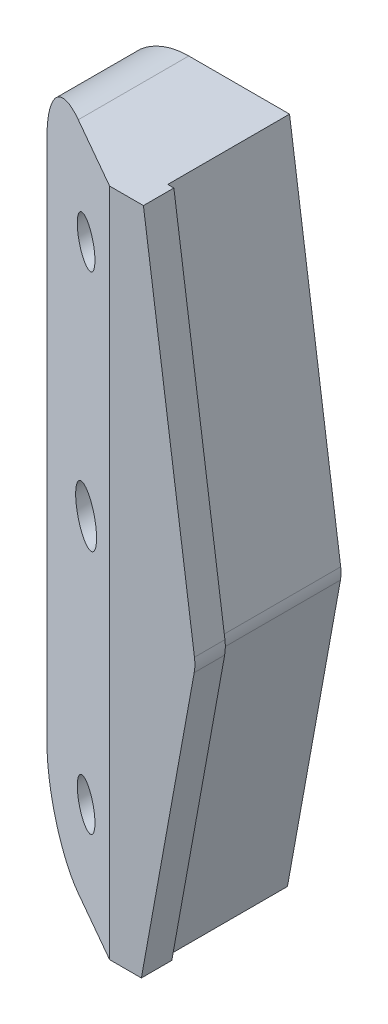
ISO-10303-21;
HEADER;
FILE_DESCRIPTION(('STEP AP214'),'2;1');
FILE_NAME('part.step','',(''),(''),'','','');
FILE_SCHEMA(('AUTOMOTIVE_DESIGN { 1 0 10303 214 1 1 1 1 }'));
ENDSEC;
DATA;
#1=APPLICATION_CONTEXT('core data for automotive mechanical design processes');
#2=APPLICATION_PROTOCOL_DEFINITION('international standard','automotive_design',2000,#1);
#3=PRODUCT_CONTEXT('',#1,'mechanical');
#4=PRODUCT('Part','Part','',(#3));
#5=PRODUCT_RELATED_PRODUCT_CATEGORY('part','',(#4));
#6=PRODUCT_DEFINITION_FORMATION('','',#4);
#7=PRODUCT_DEFINITION_CONTEXT('part definition',#1,'design');
#8=PRODUCT_DEFINITION('design','',#6,#7);
#9=PRODUCT_DEFINITION_SHAPE('','',#8);
#10=(LENGTH_UNIT() NAMED_UNIT(*) SI_UNIT(.MILLI.,.METRE.));
#11=(NAMED_UNIT(*) PLANE_ANGLE_UNIT() SI_UNIT($,.RADIAN.));
#12=(NAMED_UNIT(*) SI_UNIT($,.STERADIAN.) SOLID_ANGLE_UNIT());
#13=UNCERTAINTY_MEASURE_WITH_UNIT(LENGTH_MEASURE(1.E-05),#10,'distance_accuracy_value','');
#14=(GEOMETRIC_REPRESENTATION_CONTEXT(3) GLOBAL_UNCERTAINTY_ASSIGNED_CONTEXT((#13)) GLOBAL_UNIT_ASSIGNED_CONTEXT((#10,
#11,#12)) REPRESENTATION_CONTEXT('',''));
#15=CARTESIAN_POINT('',(0.,0.,0.));
#16=DIRECTION('',(0.,0.,1.));
#17=DIRECTION('',(1.,0.,0.));
#18=AXIS2_PLACEMENT_3D('',#15,#16,#17);
#19=CARTESIAN_POINT('',(41.9999999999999,96.5,25.));
#20=DIRECTION('',(0.,0.,-1.));
#21=DIRECTION('',(-1.,0.,0.));
#22=AXIS2_PLACEMENT_3D('',#19,#20,#21);
#23=CYLINDRICAL_SURFACE('',#22,6.99999999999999);
#24=CARTESIAN_POINT('',(41.9999999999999,96.5,20.));
#25=DIRECTION('',(0.,0.,-1.));
#26=DIRECTION('',(-1.,0.,0.));
#27=AXIS2_PLACEMENT_3D('',#24,#25,#26);
#28=CIRCLE('',#27,6.99999999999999);
#29=CARTESIAN_POINT('',(48.8872820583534,95.2488621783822,20.));
#30=VERTEX_POINT('',#29);
#31=CARTESIAN_POINT('',(48.9327633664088,97.4678802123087,20.));
#32=VERTEX_POINT('',#31);
#33=EDGE_CURVE('E154',#30,#32,#28,.F.);
#34=ORIENTED_EDGE('',*,*,#33,.T.);
#35=DIRECTION('',(0.,0.,-1.));
#36=VECTOR('',#35,1.);
#37=CARTESIAN_POINT('',(48.9327633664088,97.4678802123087,25.));
#38=LINE('',#37,#36);
#39=CARTESIAN_POINT('',(48.9327633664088,97.4678802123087,25.));
#40=VERTEX_POINT('',#39);
#41=EDGE_CURVE('E228',#40,#32,#38,.T.);
#42=ORIENTED_EDGE('',*,*,#41,.F.);
#43=CARTESIAN_POINT('',(41.9999999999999,96.5,25.));
#44=DIRECTION('',(0.,0.,1.));
#45=DIRECTION('',(1.,0.,0.));
#46=AXIS2_PLACEMENT_3D('',#43,#44,#45);
#47=CIRCLE('',#46,6.99999999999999);
#48=CARTESIAN_POINT('',(48.8872820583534,95.2488621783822,25.));
#49=VERTEX_POINT('',#48);
#50=EDGE_CURVE('E198',#49,#40,#47,.T.);
#51=ORIENTED_EDGE('',*,*,#50,.F.);
#52=DIRECTION('',(0.,0.,-1.));
#53=VECTOR('',#52,1.);
#54=CARTESIAN_POINT('',(48.8872820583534,95.2488621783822,25.));
#55=LINE('',#54,#53);
#56=EDGE_CURVE('E210',#49,#30,#55,.T.);
#57=ORIENTED_EDGE('',*,*,#56,.T.);
#58=EDGE_LOOP('',(#34,#42,#51,#57));
#59=FACE_BOUND('',#58,.T.);
#60=ADVANCED_FACE('F29',(#59),#23,.T.);
#61=CARTESIAN_POINT('',(48.9327633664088,97.4678802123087,25.));
#62=DIRECTION('',(-0.990394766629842,-0.138268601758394,0.));
#63=DIRECTION('',(0.138268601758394,-0.990394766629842,0.));
#64=AXIS2_PLACEMENT_3D('',#61,#62,#63);
#65=PLANE('',#64);
#66=DIRECTION('',(-0.138268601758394,0.990394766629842,0.));
#67=VECTOR('',#66,1.);
#68=CARTESIAN_POINT('',(48.9327633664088,97.4678802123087,20.));
#69=LINE('',#68,#67);
#70=CARTESIAN_POINT('',(40.5517040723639,157.5,20.));
#71=VERTEX_POINT('',#70);
#72=EDGE_CURVE('E146',#32,#71,#69,.T.);
#73=ORIENTED_EDGE('',*,*,#72,.T.);
#74=DIRECTION('',(0.,0.,-1.));
#75=VECTOR('',#74,1.);
#76=CARTESIAN_POINT('',(40.5517040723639,157.5,25.));
#77=LINE('',#76,#75);
#78=CARTESIAN_POINT('',(40.5517040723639,157.5,25.));
#79=VERTEX_POINT('',#78);
#80=EDGE_CURVE('E225',#79,#71,#77,.T.);
#81=ORIENTED_EDGE('',*,*,#80,.F.);
#82=DIRECTION('',(-0.138268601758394,0.990394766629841,0.));
#83=VECTOR('',#82,1.);
#84=CARTESIAN_POINT('',(48.9327633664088,97.4678802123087,25.));
#85=LINE('',#84,#83);
#86=EDGE_CURVE('E201',#40,#79,#85,.T.);
#87=ORIENTED_EDGE('',*,*,#86,.F.);
#88=ORIENTED_EDGE('',*,*,#41,.T.);
#89=EDGE_LOOP('',(#73,#81,#87,#88));
#90=FACE_BOUND('',#89,.T.);
#91=ADVANCED_FACE('F307',(#90),#65,.F.);
#92=CARTESIAN_POINT('',(40.2132642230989,47.5,25.));
#93=DIRECTION('',(-0.983897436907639,0.178733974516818,0.));
#94=DIRECTION('',(-0.178733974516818,-0.983897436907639,0.));
#95=AXIS2_PLACEMENT_3D('',#92,#93,#94);
#96=PLANE('',#95);
#97=DIRECTION('',(0.178733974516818,0.983897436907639,0.));
#98=VECTOR('',#97,1.);
#99=CARTESIAN_POINT('',(38.6864363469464,39.0950952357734,20.));
#100=LINE('',#99,#98);
#101=CARTESIAN_POINT('',(40.2132642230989,47.5,20.));
#102=VERTEX_POINT('',#101);
#103=EDGE_CURVE('E157',#102,#30,#100,.T.);
#104=ORIENTED_EDGE('',*,*,#103,.T.);
#105=ORIENTED_EDGE('',*,*,#56,.F.);
#106=DIRECTION('',(0.178733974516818,0.983897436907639,0.));
#107=VECTOR('',#106,1.);
#108=CARTESIAN_POINT('',(40.2132642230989,47.5,25.));
#109=LINE('',#108,#107);
#110=CARTESIAN_POINT('',(40.2132642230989,47.5,25.));
#111=VERTEX_POINT('',#110);
#112=EDGE_CURVE('E208',#111,#49,#109,.T.);
#113=ORIENTED_EDGE('',*,*,#112,.F.);
#114=DIRECTION('',(0.,0.,-1.));
#115=VECTOR('',#114,1.);
#116=CARTESIAN_POINT('',(40.2132642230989,47.5,25.));
#117=LINE('',#116,#115);
#118=EDGE_CURVE('E213',#111,#102,#117,.T.);
#119=ORIENTED_EDGE('',*,*,#118,.T.);
#120=EDGE_LOOP('',(#104,#105,#113,#119));
#121=FACE_BOUND('',#120,.T.);
#122=ADVANCED_FACE('F304',(#121),#96,.F.);
#123=CARTESIAN_POINT('',(40.5517040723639,157.5,25.));
#124=DIRECTION('',(0.,-1.,0.));
#125=DIRECTION('',(0.,0.,-1.));
#126=AXIS2_PLACEMENT_3D('',#123,#124,#125);
#127=PLANE('',#126);
#128=DIRECTION('',(1.,0.,0.));
#129=VECTOR('',#128,1.);
#130=CARTESIAN_POINT('',(40.5517040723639,157.5,20.));
#131=LINE('',#130,#129);
#132=CARTESIAN_POINT('',(39.5420056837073,157.5,20.));
#133=VERTEX_POINT('',#132);
#134=EDGE_CURVE('E170',#133,#71,#131,.T.);
#135=ORIENTED_EDGE('',*,*,#134,.F.);
#136=DIRECTION('',(0.,0.,-1.));
#137=VECTOR('',#136,1.);
#138=CARTESIAN_POINT('',(39.5420056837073,157.5,25.));
#139=LINE('',#138,#137);
#140=CARTESIAN_POINT('',(39.5420056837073,157.5,0.));
#141=VERTEX_POINT('',#140);
#142=EDGE_CURVE('E165',#133,#141,#139,.T.);
#143=ORIENTED_EDGE('',*,*,#142,.T.);
#144=DIRECTION('',(-1.,0.,0.));
#145=VECTOR('',#144,1.);
#146=CARTESIAN_POINT('',(40.5517040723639,157.5,0.));
#147=LINE('',#146,#145);
#148=CARTESIAN_POINT('',(23.,157.5,0.));
#149=VERTEX_POINT('',#148);
#150=EDGE_CURVE('E185',#141,#149,#147,.T.);
#151=ORIENTED_EDGE('',*,*,#150,.T.);
#152=DIRECTION('',(0.,0.,-1.));
#153=VECTOR('',#152,1.);
#154=CARTESIAN_POINT('',(23.,157.5,25.));
#155=LINE('',#154,#153);
#156=CARTESIAN_POINT('',(23.,157.5,18.1428571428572));
#157=VERTEX_POINT('',#156);
#158=EDGE_CURVE('E222',#157,#149,#155,.T.);
#159=ORIENTED_EDGE('',*,*,#158,.F.);
#160=DIRECTION('',(0.868243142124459,0.,0.496138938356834));
#161=VECTOR('',#160,1.);
#162=CARTESIAN_POINT('',(-7.71420242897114,157.5,0.591884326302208));
#163=LINE('',#162,#161);
#164=CARTESIAN_POINT('',(35.,157.5,25.));
#165=VERTEX_POINT('',#164);
#166=EDGE_CURVE('E173',#157,#165,#163,.T.);
#167=ORIENTED_EDGE('',*,*,#166,.T.);
#168=DIRECTION('',(-1.,0.,0.));
#169=VECTOR('',#168,1.);
#170=CARTESIAN_POINT('',(40.5517040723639,157.5,25.));
#171=LINE('',#170,#169);
#172=EDGE_CURVE('E203',#79,#165,#171,.T.);
#173=ORIENTED_EDGE('',*,*,#172,.F.);
#174=ORIENTED_EDGE('',*,*,#80,.T.);
#175=EDGE_LOOP('',(#135,#143,#151,#159,#167,#173,#174));
#176=FACE_BOUND('',#175,.T.);
#177=ADVANCED_FACE('F294',(#176),#127,.F.);
#178=CARTESIAN_POINT('',(23.,145.5,25.));
#179=DIRECTION('',(0.,0.,-1.));
#180=DIRECTION('',(-1.,0.,0.));
#181=AXIS2_PLACEMENT_3D('',#178,#179,#180);
#182=CYLINDRICAL_SURFACE('',#181,12.);
#183=DIRECTION('',(0.,0.,-1.));
#184=VECTOR('',#183,1.);
#185=CARTESIAN_POINT('',(11.,145.5,25.));
#186=LINE('',#185,#184);
#187=CARTESIAN_POINT('',(11.,145.5,11.2857142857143));
#188=VERTEX_POINT('',#187);
#189=CARTESIAN_POINT('',(11.,145.5,0.));
#190=VERTEX_POINT('',#189);
#191=EDGE_CURVE('E220',#188,#190,#186,.T.);
#192=ORIENTED_EDGE('',*,*,#191,.F.);
#193=CARTESIAN_POINT('',(23.,145.5,18.1428571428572));
#194=DIRECTION('',(0.496138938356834,0.,-0.868243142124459));
#195=DIRECTION('',(-0.868243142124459,0.,-0.496138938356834));
#196=AXIS2_PLACEMENT_3D('',#193,#194,#195);
#197=ELLIPSE('',#196,13.8210132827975,12.);
#198=EDGE_CURVE('E182',#188,#157,#197,.T.);
#199=ORIENTED_EDGE('',*,*,#198,.T.);
#200=ORIENTED_EDGE('',*,*,#158,.T.);
#201=CARTESIAN_POINT('',(23.,145.5,0.));
#202=DIRECTION('',(0.,0.,1.));
#203=DIRECTION('',(1.,0.,0.));
#204=AXIS2_PLACEMENT_3D('',#201,#202,#203);
#205=CIRCLE('',#204,12.);
#206=EDGE_CURVE('E187',#149,#190,#205,.T.);
#207=ORIENTED_EDGE('',*,*,#206,.T.);
#208=EDGE_LOOP('',(#192,#199,#200,#207));
#209=FACE_BOUND('',#208,.T.);
#210=ADVANCED_FACE('F296',(#209),#182,.T.);
#211=CARTESIAN_POINT('',(11.0000000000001,59.5,25.));
#212=DIRECTION('',(1.,0.,0.));
#213=DIRECTION('',(0.,1.,0.));
#214=AXIS2_PLACEMENT_3D('',#211,#212,#213);
#215=PLANE('',#214);
#216=DIRECTION('',(0.,0.,-1.));
#217=VECTOR('',#216,1.);
#218=CARTESIAN_POINT('',(11.0000000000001,59.5,25.));
#219=LINE('',#218,#217);
#220=CARTESIAN_POINT('',(11.0000000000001,59.5,11.2857142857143));
#221=VERTEX_POINT('',#220);
#222=CARTESIAN_POINT('',(11.0000000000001,59.5,0.));
#223=VERTEX_POINT('',#222);
#224=EDGE_CURVE('E218',#221,#223,#219,.T.);
#225=ORIENTED_EDGE('',*,*,#224,.F.);
#226=DIRECTION('',(0.,1.,0.));
#227=VECTOR('',#226,1.);
#228=CARTESIAN_POINT('',(11.0000000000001,59.5,11.2857142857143));
#229=LINE('',#228,#227);
#230=EDGE_CURVE('E179',#221,#188,#229,.T.);
#231=ORIENTED_EDGE('',*,*,#230,.T.);
#232=ORIENTED_EDGE('',*,*,#191,.T.);
#233=DIRECTION('',(0.,-1.,0.));
#234=VECTOR('',#233,1.);
#235=CARTESIAN_POINT('',(11.0000000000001,59.5,0.));
#236=LINE('',#235,#234);
#237=EDGE_CURVE('E190',#190,#223,#236,.T.);
#238=ORIENTED_EDGE('',*,*,#237,.T.);
#239=EDGE_LOOP('',(#225,#231,#232,#238));
#240=FACE_BOUND('',#239,.T.);
#241=ADVANCED_FACE('F278',(#240),#215,.F.);
#242=CARTESIAN_POINT('',(23.0000000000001,59.5,25.));
#243=DIRECTION('',(0.,0.,-1.));
#244=DIRECTION('',(-1.,0.,0.));
#245=AXIS2_PLACEMENT_3D('',#242,#243,#244);
#246=CYLINDRICAL_SURFACE('',#245,12.);
#247=DIRECTION('',(0.,0.,-1.));
#248=VECTOR('',#247,1.);
#249=CARTESIAN_POINT('',(23.,47.5,25.));
#250=LINE('',#249,#248);
#251=CARTESIAN_POINT('',(23.0000000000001,47.5,18.1428571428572));
#252=VERTEX_POINT('',#251);
#253=CARTESIAN_POINT('',(23.,47.5,0.));
#254=VERTEX_POINT('',#253);
#255=EDGE_CURVE('E216',#252,#254,#250,.T.);
#256=ORIENTED_EDGE('',*,*,#255,.F.);
#257=CARTESIAN_POINT('',(23.0000000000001,59.5,18.1428571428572));
#258=DIRECTION('',(0.496138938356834,0.,-0.868243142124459));
#259=DIRECTION('',(-0.868243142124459,0.,-0.496138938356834));
#260=AXIS2_PLACEMENT_3D('',#257,#258,#259);
#261=ELLIPSE('',#260,13.8210132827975,12.);
#262=EDGE_CURVE('E176',#252,#221,#261,.T.);
#263=ORIENTED_EDGE('',*,*,#262,.T.);
#264=ORIENTED_EDGE('',*,*,#224,.T.);
#265=CARTESIAN_POINT('',(23.0000000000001,59.5,0.));
#266=DIRECTION('',(0.,0.,1.));
#267=DIRECTION('',(1.,0.,0.));
#268=AXIS2_PLACEMENT_3D('',#265,#266,#267);
#269=CIRCLE('',#268,12.);
#270=EDGE_CURVE('E193',#223,#254,#269,.T.);
#271=ORIENTED_EDGE('',*,*,#270,.T.);
#272=EDGE_LOOP('',(#256,#263,#264,#271));
#273=FACE_BOUND('',#272,.T.);
#274=ADVANCED_FACE('F277',(#273),#246,.T.);
#275=CARTESIAN_POINT('',(23.,47.5,25.));
#276=DIRECTION('',(0.,1.,0.));
#277=DIRECTION('',(0.,0.,1.));
#278=AXIS2_PLACEMENT_3D('',#275,#276,#277);
#279=PLANE('',#278);
#280=DIRECTION('',(1.,0.,0.));
#281=VECTOR('',#280,1.);
#282=CARTESIAN_POINT('',(23.,47.5,0.));
#283=LINE('',#282,#281);
#284=CARTESIAN_POINT('',(39.196898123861,47.5,0.));
#285=VERTEX_POINT('',#284);
#286=EDGE_CURVE('E196',#254,#285,#283,.T.);
#287=ORIENTED_EDGE('',*,*,#286,.T.);
#288=DIRECTION('',(0.,0.,1.));
#289=VECTOR('',#288,1.);
#290=CARTESIAN_POINT('',(39.196898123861,47.5,25.));
#291=LINE('',#290,#289);
#292=CARTESIAN_POINT('',(39.196898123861,47.5,20.));
#293=VERTEX_POINT('',#292);
#294=EDGE_CURVE('E45',#285,#293,#291,.T.);
#295=ORIENTED_EDGE('',*,*,#294,.T.);
#296=DIRECTION('',(-1.,0.,0.));
#297=VECTOR('',#296,1.);
#298=CARTESIAN_POINT('',(23.,47.5,20.));
#299=LINE('',#298,#297);
#300=EDGE_CURVE('E168',#102,#293,#299,.T.);
#301=ORIENTED_EDGE('',*,*,#300,.F.);
#302=ORIENTED_EDGE('',*,*,#118,.F.);
#303=DIRECTION('',(1.,0.,0.));
#304=VECTOR('',#303,1.);
#305=CARTESIAN_POINT('',(23.,47.5,25.));
#306=LINE('',#305,#304);
#307=CARTESIAN_POINT('',(35.,47.5,25.));
#308=VERTEX_POINT('',#307);
#309=EDGE_CURVE('E206',#308,#111,#306,.T.);
#310=ORIENTED_EDGE('',*,*,#309,.F.);
#311=DIRECTION('',(0.868243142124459,0.,0.496138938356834));
#312=VECTOR('',#311,1.);
#313=CARTESIAN_POINT('',(-7.71420242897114,47.5,0.591884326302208));
#314=LINE('',#313,#312);
#315=EDGE_CURVE('E52',#252,#308,#314,.T.);
#316=ORIENTED_EDGE('',*,*,#315,.F.);
#317=ORIENTED_EDGE('',*,*,#255,.T.);
#318=EDGE_LOOP('',(#287,#295,#301,#302,#310,#316,#317));
#319=FACE_BOUND('',#318,.T.);
#320=ADVANCED_FACE('F283',(#319),#279,.F.);
#321=CARTESIAN_POINT('',(41.9999999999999,96.5,25.));
#322=DIRECTION('',(0.,0.,1.));
#323=DIRECTION('',(1.,0.,0.));
#324=AXIS2_PLACEMENT_3D('',#321,#322,#323);
#325=PLANE('',#324);
#326=DIRECTION('',(0.,1.,0.));
#327=VECTOR('',#326,1.);
#328=CARTESIAN_POINT('',(35.,96.5,25.));
#329=LINE('',#328,#327);
#330=EDGE_CURVE('E37',#308,#165,#329,.T.);
#331=ORIENTED_EDGE('',*,*,#330,.F.);
#332=ORIENTED_EDGE('',*,*,#309,.T.);
#333=ORIENTED_EDGE('',*,*,#112,.T.);
#334=ORIENTED_EDGE('',*,*,#50,.T.);
#335=ORIENTED_EDGE('',*,*,#86,.T.);
#336=ORIENTED_EDGE('',*,*,#172,.T.);
#337=EDGE_LOOP('',(#331,#332,#333,#334,#335,#336));
#338=FACE_BOUND('',#337,.T.);
#339=ADVANCED_FACE('F256',(#338),#325,.T.);
#340=CARTESIAN_POINT('',(41.9999999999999,96.5,0.));
#341=DIRECTION('',(0.,0.,1.));
#342=DIRECTION('',(1.,0.,0.));
#343=AXIS2_PLACEMENT_3D('',#340,#341,#342);
#344=PLANE('',#343);
#345=CARTESIAN_POINT('',(26.,62.5,0.));
#346=DIRECTION('',(0.,0.,-1.));
#347=DIRECTION('',(-1.,0.,0.));
#348=AXIS2_PLACEMENT_3D('',#345,#346,#347);
#349=CIRCLE('',#348,3.375);
#350=CARTESIAN_POINT('',(22.625,62.5,0.));
#351=VERTEX_POINT('',#350);
#352=EDGE_CURVE('E245',#351,#351,#349,.T.);
#353=ORIENTED_EDGE('',*,*,#352,.F.);
#354=EDGE_LOOP('',(#353));
#355=FACE_BOUND('',#354,.T.);
#356=CARTESIAN_POINT('',(26.,103.5,0.));
#357=DIRECTION('',(0.,0.,-1.));
#358=DIRECTION('',(-1.,0.,0.));
#359=AXIS2_PLACEMENT_3D('',#356,#357,#358);
#360=CIRCLE('',#359,4.);
#361=CARTESIAN_POINT('',(22.,103.5,0.));
#362=VERTEX_POINT('',#361);
#363=EDGE_CURVE('E236',#362,#362,#360,.T.);
#364=ORIENTED_EDGE('',*,*,#363,.F.);
#365=EDGE_LOOP('',(#364));
#366=FACE_BOUND('',#365,.T.);
#367=CARTESIAN_POINT('',(26.,142.5,0.));
#368=DIRECTION('',(0.,0.,-1.));
#369=DIRECTION('',(-1.,0.,0.));
#370=AXIS2_PLACEMENT_3D('',#367,#368,#369);
#371=CIRCLE('',#370,3.375);
#372=CARTESIAN_POINT('',(22.625,142.5,0.));
#373=VERTEX_POINT('',#372);
#374=EDGE_CURVE('E233',#373,#373,#371,.T.);
#375=ORIENTED_EDGE('',*,*,#374,.F.);
#376=EDGE_LOOP('',(#375));
#377=FACE_BOUND('',#376,.T.);
#378=ORIENTED_EDGE('',*,*,#150,.F.);
#379=DIRECTION('',(-0.138268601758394,0.990394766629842,0.));
#380=VECTOR('',#379,1.);
#381=CARTESIAN_POINT('',(47.942368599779,97.3296116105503,0.));
#382=LINE('',#381,#380);
#383=CARTESIAN_POINT('',(47.942368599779,97.3296116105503,0.));
#384=VERTEX_POINT('',#383);
#385=EDGE_CURVE('E142',#384,#141,#382,.T.);
#386=ORIENTED_EDGE('',*,*,#385,.F.);
#387=CARTESIAN_POINT('',(41.9999999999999,96.5,0.));
#388=DIRECTION('',(0.,0.,1.));
#389=DIRECTION('',(-1.,0.,0.));
#390=AXIS2_PLACEMENT_3D('',#387,#388,#389);
#391=CIRCLE('',#390,5.99999999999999);
#392=CARTESIAN_POINT('',(47.9033846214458,95.4275961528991,0.));
#393=VERTEX_POINT('',#392);
#394=EDGE_CURVE('E134',#393,#384,#391,.T.);
#395=ORIENTED_EDGE('',*,*,#394,.F.);
#396=DIRECTION('',(-0.178733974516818,-0.983897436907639,0.));
#397=VECTOR('',#396,1.);
#398=CARTESIAN_POINT('',(47.9033846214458,95.4275961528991,0.));
#399=LINE('',#398,#397);
#400=EDGE_CURVE('E11',#393,#285,#399,.T.);
#401=ORIENTED_EDGE('',*,*,#400,.T.);
#402=ORIENTED_EDGE('',*,*,#286,.F.);
#403=ORIENTED_EDGE('',*,*,#270,.F.);
#404=ORIENTED_EDGE('',*,*,#237,.F.);
#405=ORIENTED_EDGE('',*,*,#206,.F.);
#406=EDGE_LOOP('',(#378,#386,#395,#401,#402,#403,#404,#405));
#407=FACE_BOUND('',#406,.T.);
#408=ADVANCED_FACE('F141',(#355,#366,#377,#407),#344,.F.);
#409=CARTESIAN_POINT('',(-7.71420242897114,157.5,0.591884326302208));
#410=DIRECTION('',(0.496138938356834,0.,-0.868243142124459));
#411=DIRECTION('',(-0.868243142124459,0.,-0.496138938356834));
#412=AXIS2_PLACEMENT_3D('',#409,#410,#411);
#413=PLANE('',#412);
#414=CARTESIAN_POINT('',(26.,62.5,19.8571428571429));
#415=DIRECTION('',(0.496138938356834,0.,-0.868243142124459));
#416=DIRECTION('',(-0.868243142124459,0.,-0.496138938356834));
#417=AXIS2_PLACEMENT_3D('',#414,#415,#416);
#418=ELLIPSE('',#417,3.8871599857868,3.375);
#419=CARTESIAN_POINT('',(22.625,62.5,17.9285714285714));
#420=VERTEX_POINT('',#419);
#421=EDGE_CURVE('E32',#420,#420,#418,.T.);
#422=ORIENTED_EDGE('',*,*,#421,.T.);
#423=EDGE_LOOP('',(#422));
#424=FACE_BOUND('',#423,.T.);
#425=CARTESIAN_POINT('',(26.,103.5,19.8571428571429));
#426=DIRECTION('',(0.496138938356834,0.,-0.868243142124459));
#427=DIRECTION('',(-0.868243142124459,0.,-0.496138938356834));
#428=AXIS2_PLACEMENT_3D('',#425,#426,#427);
#429=ELLIPSE('',#428,4.60700442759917,4.);
#430=CARTESIAN_POINT('',(22.,103.5,17.5714285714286));
#431=VERTEX_POINT('',#430);
#432=EDGE_CURVE('E234',#431,#431,#429,.T.);
#433=ORIENTED_EDGE('',*,*,#432,.T.);
#434=EDGE_LOOP('',(#433));
#435=FACE_BOUND('',#434,.T.);
#436=CARTESIAN_POINT('',(26.,142.5,19.8571428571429));
#437=DIRECTION('',(0.496138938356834,0.,-0.868243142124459));
#438=DIRECTION('',(-0.868243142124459,0.,-0.496138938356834));
#439=AXIS2_PLACEMENT_3D('',#436,#437,#438);
#440=ELLIPSE('',#439,3.8871599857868,3.375);
#441=CARTESIAN_POINT('',(22.625,142.5,17.9285714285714));
#442=VERTEX_POINT('',#441);
#443=EDGE_CURVE('E148',#442,#442,#440,.T.);
#444=ORIENTED_EDGE('',*,*,#443,.T.);
#445=EDGE_LOOP('',(#444));
#446=FACE_BOUND('',#445,.T.);
#447=ORIENTED_EDGE('',*,*,#230,.F.);
#448=ORIENTED_EDGE('',*,*,#262,.F.);
#449=ORIENTED_EDGE('',*,*,#315,.T.);
#450=ORIENTED_EDGE('',*,*,#330,.T.);
#451=ORIENTED_EDGE('',*,*,#166,.F.);
#452=ORIENTED_EDGE('',*,*,#198,.F.);
#453=EDGE_LOOP('',(#447,#448,#449,#450,#451,#452));
#454=FACE_BOUND('',#453,.T.);
#455=ADVANCED_FACE('F255',(#424,#435,#446,#454),#413,.F.);
#456=CARTESIAN_POINT('',(41.9999999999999,96.5,20.));
#457=DIRECTION('',(0.,0.,-1.));
#458=DIRECTION('',(-1.,0.,0.));
#459=AXIS2_PLACEMENT_3D('',#456,#457,#458);
#460=PLANE('',#459);
#461=ORIENTED_EDGE('',*,*,#134,.T.);
#462=ORIENTED_EDGE('',*,*,#72,.F.);
#463=ORIENTED_EDGE('',*,*,#33,.F.);
#464=ORIENTED_EDGE('',*,*,#103,.F.);
#465=ORIENTED_EDGE('',*,*,#300,.T.);
#466=DIRECTION('',(0.178733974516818,0.983897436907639,0.));
#467=VECTOR('',#466,1.);
#468=CARTESIAN_POINT('',(37.7025389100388,39.2738292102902,20.));
#469=LINE('',#468,#467);
#470=CARTESIAN_POINT('',(47.9033846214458,95.4275961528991,20.));
#471=VERTEX_POINT('',#470);
#472=EDGE_CURVE('E160',#293,#471,#469,.T.);
#473=ORIENTED_EDGE('',*,*,#472,.T.);
#474=CARTESIAN_POINT('',(41.9999999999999,96.5,20.));
#475=DIRECTION('',(0.,0.,1.));
#476=DIRECTION('',(-1.,0.,0.));
#477=AXIS2_PLACEMENT_3D('',#474,#475,#476);
#478=CIRCLE('',#477,5.99999999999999);
#479=CARTESIAN_POINT('',(47.942368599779,97.3296116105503,20.));
#480=VERTEX_POINT('',#479);
#481=EDGE_CURVE('E137',#471,#480,#478,.T.);
#482=ORIENTED_EDGE('',*,*,#481,.T.);
#483=DIRECTION('',(-0.138268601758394,0.990394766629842,0.));
#484=VECTOR('',#483,1.);
#485=CARTESIAN_POINT('',(47.942368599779,97.3296116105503,20.));
#486=LINE('',#485,#484);
#487=EDGE_CURVE('E143',#480,#133,#486,.T.);
#488=ORIENTED_EDGE('',*,*,#487,.T.);
#489=EDGE_LOOP('',(#461,#462,#463,#464,#465,#473,#482,#488));
#490=FACE_BOUND('',#489,.T.);
#491=ADVANCED_FACE('F269',(#490),#460,.T.);
#492=CARTESIAN_POINT('',(47.942368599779,97.3296116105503,20.));
#493=DIRECTION('',(-0.990394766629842,-0.138268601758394,0.));
#494=DIRECTION('',(0.138268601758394,-0.990394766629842,0.));
#495=AXIS2_PLACEMENT_3D('',#492,#493,#494);
#496=PLANE('',#495);
#497=ORIENTED_EDGE('',*,*,#487,.F.);
#498=DIRECTION('',(0.,0.,-1.));
#499=VECTOR('',#498,1.);
#500=CARTESIAN_POINT('',(47.942368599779,97.3296116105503,20.));
#501=LINE('',#500,#499);
#502=EDGE_CURVE('E138',#480,#384,#501,.T.);
#503=ORIENTED_EDGE('',*,*,#502,.T.);
#504=ORIENTED_EDGE('',*,*,#385,.T.);
#505=ORIENTED_EDGE('',*,*,#142,.F.);
#506=EDGE_LOOP('',(#497,#503,#504,#505));
#507=FACE_BOUND('',#506,.T.);
#508=ADVANCED_FACE('F319',(#507),#496,.F.);
#509=CARTESIAN_POINT('',(37.7025389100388,39.2738292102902,20.));
#510=DIRECTION('',(-0.983897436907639,0.178733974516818,0.));
#511=DIRECTION('',(-0.178733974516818,-0.983897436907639,0.));
#512=AXIS2_PLACEMENT_3D('',#509,#510,#511);
#513=PLANE('',#512);
#514=ORIENTED_EDGE('',*,*,#400,.F.);
#515=DIRECTION('',(0.,0.,-1.));
#516=VECTOR('',#515,1.);
#517=CARTESIAN_POINT('',(47.9033846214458,95.4275961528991,20.));
#518=LINE('',#517,#516);
#519=EDGE_CURVE('E125',#471,#393,#518,.T.);
#520=ORIENTED_EDGE('',*,*,#519,.F.);
#521=ORIENTED_EDGE('',*,*,#472,.F.);
#522=ORIENTED_EDGE('',*,*,#294,.F.);
#523=EDGE_LOOP('',(#514,#520,#521,#522));
#524=FACE_BOUND('',#523,.T.);
#525=ADVANCED_FACE('F124',(#524),#513,.F.);
#526=CARTESIAN_POINT('',(41.9999999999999,96.5,20.));
#527=DIRECTION('',(0.,0.,-1.));
#528=DIRECTION('',(-1.,0.,0.));
#529=AXIS2_PLACEMENT_3D('',#526,#527,#528);
#530=CYLINDRICAL_SURFACE('',#529,5.99999999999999);
#531=ORIENTED_EDGE('',*,*,#394,.T.);
#532=ORIENTED_EDGE('',*,*,#502,.F.);
#533=ORIENTED_EDGE('',*,*,#481,.F.);
#534=ORIENTED_EDGE('',*,*,#519,.T.);
#535=EDGE_LOOP('',(#531,#532,#533,#534));
#536=FACE_BOUND('',#535,.T.);
#537=ADVANCED_FACE('F133',(#536),#530,.T.);
#538=CARTESIAN_POINT('',(26.,142.5,25.));
#539=DIRECTION('',(0.,0.,-1.));
#540=DIRECTION('',(-1.,0.,0.));
#541=AXIS2_PLACEMENT_3D('',#538,#539,#540);
#542=CYLINDRICAL_SURFACE('',#541,3.375);
#543=ORIENTED_EDGE('',*,*,#374,.T.);
#544=EDGE_LOOP('',(#543));
#545=FACE_BOUND('',#544,.T.);
#546=ORIENTED_EDGE('',*,*,#443,.F.);
#547=EDGE_LOOP('',(#546));
#548=FACE_BOUND('',#547,.T.);
#549=ADVANCED_FACE('F261',(#545,#548),#542,.F.);
#550=CARTESIAN_POINT('',(26.,103.5,25.));
#551=DIRECTION('',(0.,0.,-1.));
#552=DIRECTION('',(-1.,0.,0.));
#553=AXIS2_PLACEMENT_3D('',#550,#551,#552);
#554=CYLINDRICAL_SURFACE('',#553,4.);
#555=ORIENTED_EDGE('',*,*,#363,.T.);
#556=EDGE_LOOP('',(#555));
#557=FACE_BOUND('',#556,.T.);
#558=ORIENTED_EDGE('',*,*,#432,.F.);
#559=EDGE_LOOP('',(#558));
#560=FACE_BOUND('',#559,.T.);
#561=ADVANCED_FACE('F264',(#557,#560),#554,.F.);
#562=CARTESIAN_POINT('',(26.,62.5,25.));
#563=DIRECTION('',(0.,0.,-1.));
#564=DIRECTION('',(-1.,0.,0.));
#565=AXIS2_PLACEMENT_3D('',#562,#563,#564);
#566=CYLINDRICAL_SURFACE('',#565,3.375);
#567=ORIENTED_EDGE('',*,*,#352,.T.);
#568=EDGE_LOOP('',(#567));
#569=FACE_BOUND('',#568,.T.);
#570=ORIENTED_EDGE('',*,*,#421,.F.);
#571=EDGE_LOOP('',(#570));
#572=FACE_BOUND('',#571,.T.);
#573=ADVANCED_FACE('F250',(#569,#572),#566,.F.);
#574=CLOSED_SHELL('',(#60,#91,#122,#177,#210,#241,#274,#320,#339,#408,#455,#491,#508,#525,#537,
#549,#561,#573));
#575=MANIFOLD_SOLID_BREP('B2',#574);
#576=ADVANCED_BREP_SHAPE_REPRESENTATION('',(#18,#575),#14);
#577=SHAPE_DEFINITION_REPRESENTATION(#9,#576);
ENDSEC;
END-ISO-10303-21;
